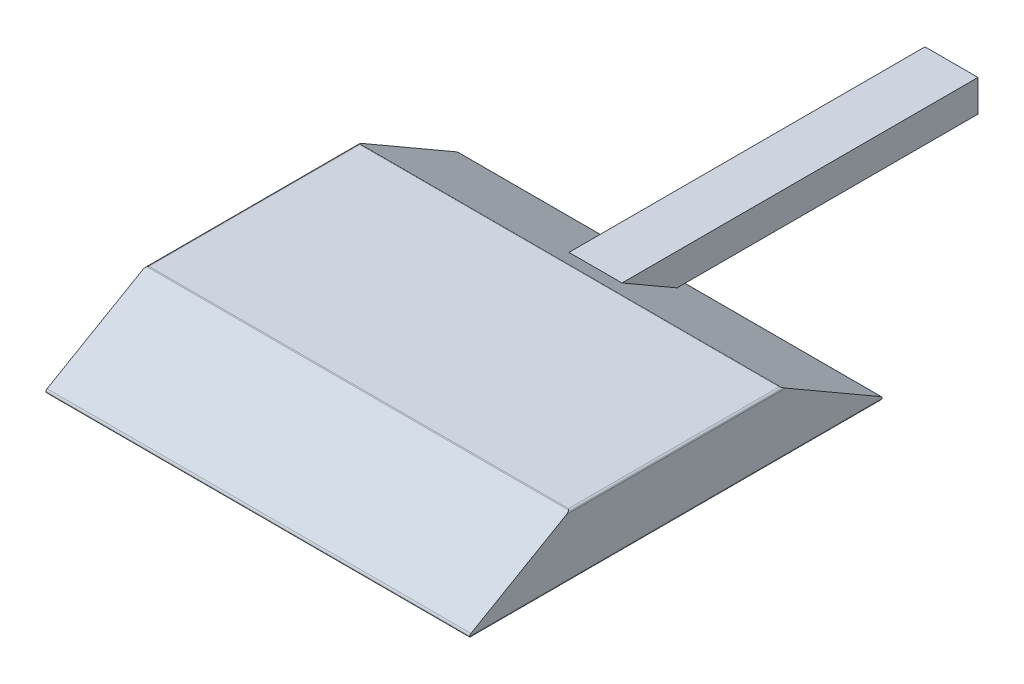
ISO-10303-21;
HEADER;
FILE_DESCRIPTION(('STEP AP214'),'2;1');
FILE_NAME('part.step','',(''),(''),'','','');
FILE_SCHEMA(('AUTOMOTIVE_DESIGN { 1 0 10303 214 1 1 1 1 }'));
ENDSEC;
DATA;
#1=APPLICATION_CONTEXT('core data for automotive mechanical design processes');
#2=APPLICATION_PROTOCOL_DEFINITION('international standard','automotive_design',2000,#1);
#3=PRODUCT_CONTEXT('',#1,'mechanical');
#4=PRODUCT('Part','Part','',(#3));
#5=PRODUCT_RELATED_PRODUCT_CATEGORY('part','',(#4));
#6=PRODUCT_DEFINITION_FORMATION('','',#4);
#7=PRODUCT_DEFINITION_CONTEXT('part definition',#1,'design');
#8=PRODUCT_DEFINITION('design','',#6,#7);
#9=PRODUCT_DEFINITION_SHAPE('','',#8);
#10=(LENGTH_UNIT() NAMED_UNIT(*) SI_UNIT(.MILLI.,.METRE.));
#11=(NAMED_UNIT(*) PLANE_ANGLE_UNIT() SI_UNIT($,.RADIAN.));
#12=(NAMED_UNIT(*) SI_UNIT($,.STERADIAN.) SOLID_ANGLE_UNIT());
#13=UNCERTAINTY_MEASURE_WITH_UNIT(LENGTH_MEASURE(1.E-05),#10,'distance_accuracy_value','');
#14=(GEOMETRIC_REPRESENTATION_CONTEXT(3) GLOBAL_UNCERTAINTY_ASSIGNED_CONTEXT((#13)) GLOBAL_UNIT_ASSIGNED_CONTEXT((#10,
#11,#12)) REPRESENTATION_CONTEXT('',''));
#15=CARTESIAN_POINT('',(0.,0.,0.));
#16=DIRECTION('',(0.,0.,1.));
#17=DIRECTION('',(1.,0.,0.));
#18=AXIS2_PLACEMENT_3D('',#15,#16,#17);
#19=CARTESIAN_POINT('',(25.4,3.66617420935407,-12.7));
#20=DIRECTION('',(0.,-0.866025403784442,0.499999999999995));
#21=DIRECTION('',(0.,-0.499999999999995,-0.866025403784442));
#22=AXIS2_PLACEMENT_3D('',#19,#20,#21);
#23=PLANE('',#22);
#24=DIRECTION('',(-1.,0.,0.));
#25=VECTOR('',#24,1.);
#26=CARTESIAN_POINT('',(25.4,3.63214466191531,-12.7589409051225));
#27=LINE('',#26,#25);
#28=CARTESIAN_POINT('',(-25.2730000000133,3.63214466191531,-12.7589409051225));
#29=VERTEX_POINT('',#28);
#30=CARTESIAN_POINT('',(25.2730000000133,3.63214466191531,-12.7589409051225));
#31=VERTEX_POINT('',#30);
#32=EDGE_CURVE('E218',#29,#31,#27,.F.);
#33=ORIENTED_EDGE('',*,*,#32,.T.);
#34=CARTESIAN_POINT('',(25.146,3.41217420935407,-13.1399409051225));
#35=DIRECTION('',(0.,-0.866025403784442,0.499999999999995));
#36=DIRECTION('',(0.,-0.499999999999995,-0.866025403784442));
#37=AXIS2_PLACEMENT_3D('',#34,#35,#36);
#38=ELLIPSE('',#37,0.508000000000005,0.254);
#39=CARTESIAN_POINT('',(25.4,3.41217420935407,-13.1399409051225));
#40=VERTEX_POINT('',#39);
#41=EDGE_CURVE('E221',#31,#40,#38,.F.);
#42=ORIENTED_EDGE('',*,*,#41,.T.);
#43=DIRECTION('',(0.,0.499999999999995,0.866025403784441));
#44=VECTOR('',#43,1.);
#45=CARTESIAN_POINT('',(25.4,3.66617420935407,-12.7));
#46=LINE('',#45,#44);
#47=CARTESIAN_POINT('',(25.4,-3.19220375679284,-24.5790590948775));
#48=VERTEX_POINT('',#47);
#49=EDGE_CURVE('E188',#48,#40,#46,.T.);
#50=ORIENTED_EDGE('',*,*,#49,.F.);
#51=DIRECTION('',(-1.,0.,0.));
#52=VECTOR('',#51,1.);
#53=CARTESIAN_POINT('',(25.4,-3.19220375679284,-24.5790590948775));
#54=LINE('',#53,#52);
#55=CARTESIAN_POINT('',(-25.4,-3.19220375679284,-24.5790590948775));
#56=VERTEX_POINT('',#55);
#57=EDGE_CURVE('E214',#48,#56,#54,.T.);
#58=ORIENTED_EDGE('',*,*,#57,.T.);
#59=DIRECTION('',(0.,0.499999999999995,0.866025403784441));
#60=VECTOR('',#59,1.);
#61=CARTESIAN_POINT('',(-25.4,3.66617420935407,-12.7));
#62=LINE('',#61,#60);
#63=CARTESIAN_POINT('',(-25.4,3.41217420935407,-13.1399409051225));
#64=VERTEX_POINT('',#63);
#65=EDGE_CURVE('E179',#56,#64,#62,.T.);
#66=ORIENTED_EDGE('',*,*,#65,.T.);
#67=CARTESIAN_POINT('',(-25.146,3.41217420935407,-13.1399409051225));
#68=DIRECTION('',(0.,-0.866025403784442,0.499999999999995));
#69=DIRECTION('',(0.,0.499999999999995,0.866025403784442));
#70=AXIS2_PLACEMENT_3D('',#67,#68,#69);
#71=ELLIPSE('',#70,0.508000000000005,0.254);
#72=EDGE_CURVE('E216',#64,#29,#71,.F.);
#73=ORIENTED_EDGE('',*,*,#72,.T.);
#74=EDGE_LOOP('',(#33,#42,#50,#58,#66,#73));
#75=FACE_BOUND('',#74,.T.);
#76=DIRECTION('',(0.,0.499999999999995,0.866025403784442));
#77=VECTOR('',#76,1.);
#78=CARTESIAN_POINT('',(-3.17500000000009,3.66617420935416,-12.6999999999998));
#79=LINE('',#78,#77);
#80=CARTESIAN_POINT('',(-3.17500000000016,-1.905,-22.3495567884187));
#81=VERTEX_POINT('',#80);
#82=CARTESIAN_POINT('',(-3.17500000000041,1.905,-15.7504432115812));
#83=VERTEX_POINT('',#82);
#84=EDGE_CURVE('E178',#81,#83,#79,.T.);
#85=ORIENTED_EDGE('',*,*,#84,.F.);
#86=DIRECTION('',(-1.,0.,0.));
#87=VECTOR('',#86,1.);
#88=CARTESIAN_POINT('',(25.4,-1.905,-22.3495567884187));
#89=LINE('',#88,#87);
#90=CARTESIAN_POINT('',(3.17499999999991,-1.905,-22.3495567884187));
#91=VERTEX_POINT('',#90);
#92=EDGE_CURVE('E193',#91,#81,#89,.T.);
#93=ORIENTED_EDGE('',*,*,#92,.F.);
#94=DIRECTION('',(0.,-0.499999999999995,-0.866025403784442));
#95=VECTOR('',#94,1.);
#96=CARTESIAN_POINT('',(3.17499999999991,3.66617420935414,-12.6999999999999));
#97=LINE('',#96,#95);
#98=CARTESIAN_POINT('',(3.17499999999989,1.905,-15.7504432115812));
#99=VERTEX_POINT('',#98);
#100=EDGE_CURVE('E199',#99,#91,#97,.T.);
#101=ORIENTED_EDGE('',*,*,#100,.F.);
#102=DIRECTION('',(1.,0.,0.));
#103=VECTOR('',#102,1.);
#104=CARTESIAN_POINT('',(25.4,1.905,-15.7504432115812));
#105=LINE('',#104,#103);
#106=EDGE_CURVE('E202',#83,#99,#105,.T.);
#107=ORIENTED_EDGE('',*,*,#106,.F.);
#108=EDGE_LOOP('',(#85,#93,#101,#107));
#109=FACE_BOUND('',#108,.T.);
#110=ADVANCED_FACE('F41',(#75,#109),#23,.F.);
#111=CARTESIAN_POINT('',(25.4,3.66617420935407,12.7));
#112=DIRECTION('',(0.,-1.,0.));
#113=DIRECTION('',(0.,0.,-1.));
#114=AXIS2_PLACEMENT_3D('',#111,#112,#113);
#115=PLANE('',#114);
#116=DIRECTION('',(0.,0.,1.));
#117=VECTOR('',#116,1.);
#118=CARTESIAN_POINT('',(25.146,3.66617420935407,-12.7));
#119=LINE('',#118,#117);
#120=CARTESIAN_POINT('',(25.146,3.66617420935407,12.6319409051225));
#121=VERTEX_POINT('',#120);
#122=CARTESIAN_POINT('',(25.146,3.66617420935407,-12.6319409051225));
#123=VERTEX_POINT('',#122);
#124=EDGE_CURVE('E209',#121,#123,#119,.F.);
#125=ORIENTED_EDGE('',*,*,#124,.T.);
#126=DIRECTION('',(-1.,0.,0.));
#127=VECTOR('',#126,1.);
#128=CARTESIAN_POINT('',(25.4,3.66617420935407,-12.6319409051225));
#129=LINE('',#128,#127);
#130=CARTESIAN_POINT('',(-25.146,3.66617420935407,-12.6319409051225));
#131=VERTEX_POINT('',#130);
#132=EDGE_CURVE('E211',#123,#131,#129,.T.);
#133=ORIENTED_EDGE('',*,*,#132,.T.);
#134=DIRECTION('',(0.,0.,1.));
#135=VECTOR('',#134,1.);
#136=CARTESIAN_POINT('',(-25.146,3.66617420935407,12.7));
#137=LINE('',#136,#135);
#138=CARTESIAN_POINT('',(-25.146,3.66617420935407,12.6319409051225));
#139=VERTEX_POINT('',#138);
#140=EDGE_CURVE('E205',#131,#139,#137,.T.);
#141=ORIENTED_EDGE('',*,*,#140,.T.);
#142=DIRECTION('',(-1.,0.,0.));
#143=VECTOR('',#142,1.);
#144=CARTESIAN_POINT('',(25.4,3.66617420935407,12.6319409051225));
#145=LINE('',#144,#143);
#146=EDGE_CURVE('E207',#139,#121,#145,.F.);
#147=ORIENTED_EDGE('',*,*,#146,.T.);
#148=EDGE_LOOP('',(#125,#133,#141,#147));
#149=FACE_BOUND('',#148,.T.);
#150=ADVANCED_FACE('F319',(#149),#115,.F.);
#151=CARTESIAN_POINT('',(25.4,-3.66617420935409,25.4));
#152=DIRECTION('',(0.,-0.866025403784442,-0.499999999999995));
#153=DIRECTION('',(0.,0.499999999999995,-0.866025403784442));
#154=AXIS2_PLACEMENT_3D('',#151,#152,#153);
#155=PLANE('',#154);
#156=DIRECTION('',(0.,-0.499999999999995,0.866025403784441));
#157=VECTOR('',#156,1.);
#158=CARTESIAN_POINT('',(25.4,-3.66617420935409,25.4));
#159=LINE('',#158,#157);
#160=CARTESIAN_POINT('',(25.4,3.41217420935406,13.1399409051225));
#161=VERTEX_POINT('',#160);
#162=CARTESIAN_POINT('',(25.4,-3.19220375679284,24.5790590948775));
#163=VERTEX_POINT('',#162);
#164=EDGE_CURVE('E191',#161,#163,#159,.T.);
#165=ORIENTED_EDGE('',*,*,#164,.F.);
#166=CARTESIAN_POINT('',(25.146,3.41217420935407,13.1399409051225));
#167=DIRECTION('',(0.,-0.866025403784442,-0.499999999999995));
#168=DIRECTION('',(0.,0.499999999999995,-0.866025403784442));
#169=AXIS2_PLACEMENT_3D('',#166,#167,#168);
#170=ELLIPSE('',#169,0.508000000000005,0.254);
#171=CARTESIAN_POINT('',(25.2730000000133,3.63214466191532,12.7589409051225));
#172=VERTEX_POINT('',#171);
#173=EDGE_CURVE('E238',#161,#172,#170,.F.);
#174=ORIENTED_EDGE('',*,*,#173,.T.);
#175=DIRECTION('',(-1.,0.,0.));
#176=VECTOR('',#175,1.);
#177=CARTESIAN_POINT('',(25.4,3.63214466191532,12.7589409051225));
#178=LINE('',#177,#176);
#179=CARTESIAN_POINT('',(-25.2730000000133,3.63214466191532,12.7589409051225));
#180=VERTEX_POINT('',#179);
#181=EDGE_CURVE('E236',#172,#180,#178,.T.);
#182=ORIENTED_EDGE('',*,*,#181,.T.);
#183=CARTESIAN_POINT('',(-25.146,3.41217420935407,13.1399409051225));
#184=DIRECTION('',(0.,-0.866025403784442,-0.499999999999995));
#185=DIRECTION('',(0.,-0.499999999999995,0.866025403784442));
#186=AXIS2_PLACEMENT_3D('',#183,#184,#185);
#187=ELLIPSE('',#186,0.508000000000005,0.254);
#188=CARTESIAN_POINT('',(-25.4,3.41217420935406,13.1399409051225));
#189=VERTEX_POINT('',#188);
#190=EDGE_CURVE('E234',#180,#189,#187,.F.);
#191=ORIENTED_EDGE('',*,*,#190,.T.);
#192=DIRECTION('',(0.,-0.499999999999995,0.866025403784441));
#193=VECTOR('',#192,1.);
#194=CARTESIAN_POINT('',(-25.4,-3.66617420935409,25.4));
#195=LINE('',#194,#193);
#196=CARTESIAN_POINT('',(-25.4,-3.19220375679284,24.5790590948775));
#197=VERTEX_POINT('',#196);
#198=EDGE_CURVE('E182',#189,#197,#195,.T.);
#199=ORIENTED_EDGE('',*,*,#198,.T.);
#200=DIRECTION('',(-1.,0.,0.));
#201=VECTOR('',#200,1.);
#202=CARTESIAN_POINT('',(25.4,-3.19220375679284,24.5790590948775));
#203=LINE('',#202,#201);
#204=EDGE_CURVE('E231',#197,#163,#203,.F.);
#205=ORIENTED_EDGE('',*,*,#204,.T.);
#206=EDGE_LOOP('',(#165,#174,#182,#191,#199,#205));
#207=FACE_BOUND('',#206,.T.);
#208=ADVANCED_FACE('F296',(#207),#155,.F.);
#209=CARTESIAN_POINT('',(25.4,-3.66617420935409,-25.4));
#210=DIRECTION('',(0.,1.,0.));
#211=DIRECTION('',(0.,0.,1.));
#212=AXIS2_PLACEMENT_3D('',#209,#210,#211);
#213=PLANE('',#212);
#214=DIRECTION('',(0.,0.,-1.));
#215=VECTOR('',#214,1.);
#216=CARTESIAN_POINT('',(25.146,-3.66617420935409,25.4));
#217=LINE('',#216,#215);
#218=CARTESIAN_POINT('',(25.146,-3.66617420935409,-24.4520590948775));
#219=VERTEX_POINT('',#218);
#220=CARTESIAN_POINT('',(25.146,-3.66617420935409,24.4520590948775));
#221=VERTEX_POINT('',#220);
#222=EDGE_CURVE('E50',#219,#221,#217,.F.);
#223=ORIENTED_EDGE('',*,*,#222,.T.);
#224=DIRECTION('',(-1.,0.,0.));
#225=VECTOR('',#224,1.);
#226=CARTESIAN_POINT('',(25.4,-3.66617420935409,24.4520590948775));
#227=LINE('',#226,#225);
#228=CARTESIAN_POINT('',(-25.146,-3.66617420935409,24.4520590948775));
#229=VERTEX_POINT('',#228);
#230=EDGE_CURVE('E11',#221,#229,#227,.T.);
#231=ORIENTED_EDGE('',*,*,#230,.T.);
#232=DIRECTION('',(0.,0.,-1.));
#233=VECTOR('',#232,1.);
#234=CARTESIAN_POINT('',(-25.146,-3.66617420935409,-25.4));
#235=LINE('',#234,#233);
#236=CARTESIAN_POINT('',(-25.146,-3.66617420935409,-24.4520590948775));
#237=VERTEX_POINT('',#236);
#238=EDGE_CURVE('E248',#229,#237,#235,.T.);
#239=ORIENTED_EDGE('',*,*,#238,.T.);
#240=DIRECTION('',(-1.,0.,0.));
#241=VECTOR('',#240,1.);
#242=CARTESIAN_POINT('',(25.4,-3.66617420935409,-24.4520590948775));
#243=LINE('',#242,#241);
#244=EDGE_CURVE('E61',#237,#219,#243,.F.);
#245=ORIENTED_EDGE('',*,*,#244,.T.);
#246=EDGE_LOOP('',(#223,#231,#239,#245));
#247=FACE_BOUND('',#246,.T.);
#248=ADVANCED_FACE('F305',(#247),#213,.F.);
#249=CARTESIAN_POINT('',(25.4,0.,0.));
#250=DIRECTION('',(1.,0.,0.));
#251=DIRECTION('',(0.,0.,-1.));
#252=AXIS2_PLACEMENT_3D('',#249,#250,#251);
#253=PLANE('',#252);
#254=ORIENTED_EDGE('',*,*,#49,.T.);
#255=DIRECTION('',(0.,0.,1.));
#256=VECTOR('',#255,1.);
#257=CARTESIAN_POINT('',(25.4,3.41217420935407,12.7));
#258=LINE('',#257,#256);
#259=EDGE_CURVE('E229',#40,#161,#258,.T.);
#260=ORIENTED_EDGE('',*,*,#259,.T.);
#261=ORIENTED_EDGE('',*,*,#164,.T.);
#262=CARTESIAN_POINT('',(25.4,-3.41217420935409,24.4520590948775));
#263=DIRECTION('',(1.,0.,0.));
#264=DIRECTION('',(0.,0.,-1.));
#265=AXIS2_PLACEMENT_3D('',#262,#263,#264);
#266=CIRCLE('',#265,0.254);
#267=CARTESIAN_POINT('',(25.4,-3.41217420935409,24.7060590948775));
#268=VERTEX_POINT('',#267);
#269=EDGE_CURVE('E227',#163,#268,#266,.T.);
#270=ORIENTED_EDGE('',*,*,#269,.T.);
#271=DIRECTION('',(0.,0.,-1.));
#272=VECTOR('',#271,1.);
#273=CARTESIAN_POINT('',(25.4,-3.41217420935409,-25.4));
#274=LINE('',#273,#272);
#275=CARTESIAN_POINT('',(25.4,-3.41217420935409,-24.7060590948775));
#276=VERTEX_POINT('',#275);
#277=EDGE_CURVE('E225',#268,#276,#274,.T.);
#278=ORIENTED_EDGE('',*,*,#277,.T.);
#279=CARTESIAN_POINT('',(25.4,-3.41217420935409,-24.4520590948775));
#280=DIRECTION('',(1.,0.,0.));
#281=DIRECTION('',(0.,0.,-1.));
#282=AXIS2_PLACEMENT_3D('',#279,#280,#281);
#283=CIRCLE('',#282,0.254);
#284=EDGE_CURVE('E223',#276,#48,#283,.T.);
#285=ORIENTED_EDGE('',*,*,#284,.T.);
#286=EDGE_LOOP('',(#254,#260,#261,#270,#278,#285));
#287=FACE_BOUND('',#286,.T.);
#288=ADVANCED_FACE('F281',(#287),#253,.T.);
#289=CARTESIAN_POINT('',(-25.4,0.,0.));
#290=DIRECTION('',(1.,0.,0.));
#291=DIRECTION('',(0.,0.,-1.));
#292=AXIS2_PLACEMENT_3D('',#289,#290,#291);
#293=PLANE('',#292);
#294=ORIENTED_EDGE('',*,*,#198,.F.);
#295=DIRECTION('',(0.,0.,1.));
#296=VECTOR('',#295,1.);
#297=CARTESIAN_POINT('',(-25.4,3.41217420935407,0.));
#298=LINE('',#297,#296);
#299=EDGE_CURVE('E246',#189,#64,#298,.F.);
#300=ORIENTED_EDGE('',*,*,#299,.T.);
#301=ORIENTED_EDGE('',*,*,#65,.F.);
#302=CARTESIAN_POINT('',(-25.4,-3.41217420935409,-24.4520590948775));
#303=DIRECTION('',(1.,0.,0.));
#304=DIRECTION('',(0.,0.,-1.));
#305=AXIS2_PLACEMENT_3D('',#302,#303,#304);
#306=CIRCLE('',#305,0.254);
#307=CARTESIAN_POINT('',(-25.4,-3.41217420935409,-24.7060590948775));
#308=VERTEX_POINT('',#307);
#309=EDGE_CURVE('E242',#56,#308,#306,.F.);
#310=ORIENTED_EDGE('',*,*,#309,.T.);
#311=DIRECTION('',(0.,0.,-1.));
#312=VECTOR('',#311,1.);
#313=CARTESIAN_POINT('',(-25.4,-3.41217420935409,0.));
#314=LINE('',#313,#312);
#315=CARTESIAN_POINT('',(-25.4,-3.41217420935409,24.7060590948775));
#316=VERTEX_POINT('',#315);
#317=EDGE_CURVE('E240',#308,#316,#314,.F.);
#318=ORIENTED_EDGE('',*,*,#317,.T.);
#319=CARTESIAN_POINT('',(-25.4,-3.41217420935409,24.4520590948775));
#320=DIRECTION('',(1.,0.,0.));
#321=DIRECTION('',(0.,0.,-1.));
#322=AXIS2_PLACEMENT_3D('',#319,#320,#321);
#323=CIRCLE('',#322,0.254);
#324=EDGE_CURVE('E244',#316,#197,#323,.F.);
#325=ORIENTED_EDGE('',*,*,#324,.T.);
#326=EDGE_LOOP('',(#294,#300,#301,#310,#318,#325));
#327=FACE_BOUND('',#326,.T.);
#328=ADVANCED_FACE('F308',(#327),#293,.F.);
#329=CARTESIAN_POINT('',(-3.17500000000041,1.905,-58.42));
#330=DIRECTION('',(1.,0.,0.));
#331=DIRECTION('',(0.,0.,-1.));
#332=AXIS2_PLACEMENT_3D('',#329,#330,#331);
#333=PLANE('',#332);
#334=DIRECTION('',(0.,0.,1.));
#335=VECTOR('',#334,1.);
#336=CARTESIAN_POINT('',(-3.17500000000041,-1.905,-58.42));
#337=LINE('',#336,#335);
#338=CARTESIAN_POINT('',(-3.17500000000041,-1.905,-58.42));
#339=VERTEX_POINT('',#338);
#340=EDGE_CURVE('E482',#339,#81,#337,.T.);
#341=ORIENTED_EDGE('',*,*,#340,.T.);
#342=ORIENTED_EDGE('',*,*,#84,.T.);
#343=DIRECTION('',(0.,0.,1.));
#344=VECTOR('',#343,1.);
#345=CARTESIAN_POINT('',(-3.17500000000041,1.905,-58.42));
#346=LINE('',#345,#344);
#347=CARTESIAN_POINT('',(-3.17500000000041,1.905,-58.42));
#348=VERTEX_POINT('',#347);
#349=EDGE_CURVE('E159',#348,#83,#346,.T.);
#350=ORIENTED_EDGE('',*,*,#349,.F.);
#351=DIRECTION('',(0.,1.,0.));
#352=VECTOR('',#351,1.);
#353=CARTESIAN_POINT('',(-3.17500000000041,1.905,-58.42));
#354=LINE('',#353,#352);
#355=EDGE_CURVE('E165',#339,#348,#354,.T.);
#356=ORIENTED_EDGE('',*,*,#355,.F.);
#357=EDGE_LOOP('',(#341,#342,#350,#356));
#358=FACE_BOUND('',#357,.T.);
#359=ADVANCED_FACE('F177',(#358),#333,.F.);
#360=CARTESIAN_POINT('',(3.17499999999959,1.905,-58.42));
#361=DIRECTION('',(0.,-1.,0.));
#362=DIRECTION('',(0.,0.,-1.));
#363=AXIS2_PLACEMENT_3D('',#360,#361,#362);
#364=PLANE('',#363);
#365=ORIENTED_EDGE('',*,*,#349,.T.);
#366=ORIENTED_EDGE('',*,*,#106,.T.);
#367=DIRECTION('',(0.,0.,1.));
#368=VECTOR('',#367,1.);
#369=CARTESIAN_POINT('',(3.17499999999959,1.905,-58.42));
#370=LINE('',#369,#368);
#371=CARTESIAN_POINT('',(3.17499999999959,1.905,-58.42));
#372=VERTEX_POINT('',#371);
#373=EDGE_CURVE('E161',#372,#99,#370,.T.);
#374=ORIENTED_EDGE('',*,*,#373,.F.);
#375=DIRECTION('',(1.,0.,0.));
#376=VECTOR('',#375,1.);
#377=CARTESIAN_POINT('',(3.17499999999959,1.905,-58.42));
#378=LINE('',#377,#376);
#379=EDGE_CURVE('E154',#348,#372,#378,.T.);
#380=ORIENTED_EDGE('',*,*,#379,.F.);
#381=EDGE_LOOP('',(#365,#366,#374,#380));
#382=FACE_BOUND('',#381,.T.);
#383=ADVANCED_FACE('F156',(#382),#364,.F.);
#384=CARTESIAN_POINT('',(3.17499999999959,1.905,-58.42));
#385=DIRECTION('',(-1.,0.,0.));
#386=DIRECTION('',(0.,0.,1.));
#387=AXIS2_PLACEMENT_3D('',#384,#385,#386);
#388=PLANE('',#387);
#389=ORIENTED_EDGE('',*,*,#373,.T.);
#390=ORIENTED_EDGE('',*,*,#100,.T.);
#391=DIRECTION('',(0.,0.,1.));
#392=VECTOR('',#391,1.);
#393=CARTESIAN_POINT('',(3.17499999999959,-1.905,-58.42));
#394=LINE('',#393,#392);
#395=CARTESIAN_POINT('',(3.17499999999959,-1.905,-58.42));
#396=VERTEX_POINT('',#395);
#397=EDGE_CURVE('E184',#396,#91,#394,.T.);
#398=ORIENTED_EDGE('',*,*,#397,.F.);
#399=DIRECTION('',(0.,-1.,0.));
#400=VECTOR('',#399,1.);
#401=CARTESIAN_POINT('',(3.17499999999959,1.905,-58.42));
#402=LINE('',#401,#400);
#403=EDGE_CURVE('E164',#372,#396,#402,.T.);
#404=ORIENTED_EDGE('',*,*,#403,.F.);
#405=EDGE_LOOP('',(#389,#390,#398,#404));
#406=FACE_BOUND('',#405,.T.);
#407=ADVANCED_FACE('F408',(#406),#388,.F.);
#408=CARTESIAN_POINT('',(3.17499999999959,-1.905,-58.42));
#409=DIRECTION('',(0.,1.,0.));
#410=DIRECTION('',(0.,0.,1.));
#411=AXIS2_PLACEMENT_3D('',#408,#409,#410);
#412=PLANE('',#411);
#413=ORIENTED_EDGE('',*,*,#397,.T.);
#414=ORIENTED_EDGE('',*,*,#92,.T.);
#415=ORIENTED_EDGE('',*,*,#340,.F.);
#416=DIRECTION('',(-1.,0.,0.));
#417=VECTOR('',#416,1.);
#418=CARTESIAN_POINT('',(3.17499999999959,-1.905,-58.42));
#419=LINE('',#418,#417);
#420=EDGE_CURVE('E170',#396,#339,#419,.T.);
#421=ORIENTED_EDGE('',*,*,#420,.F.);
#422=EDGE_LOOP('',(#413,#414,#415,#421));
#423=FACE_BOUND('',#422,.T.);
#424=ADVANCED_FACE('F333',(#423),#412,.F.);
#425=CARTESIAN_POINT('',(-4.0946667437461E-13,0.,-58.42));
#426=DIRECTION('',(0.,0.,-1.));
#427=DIRECTION('',(-1.,0.,0.));
#428=AXIS2_PLACEMENT_3D('',#425,#426,#427);
#429=PLANE('',#428);
#430=ORIENTED_EDGE('',*,*,#355,.T.);
#431=ORIENTED_EDGE('',*,*,#379,.T.);
#432=ORIENTED_EDGE('',*,*,#403,.T.);
#433=ORIENTED_EDGE('',*,*,#420,.T.);
#434=EDGE_LOOP('',(#430,#431,#432,#433));
#435=FACE_BOUND('',#434,.T.);
#436=ADVANCED_FACE('F168',(#435),#429,.T.);
#437=CARTESIAN_POINT('',(25.4,3.41217420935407,12.6319409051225));
#438=DIRECTION('',(-1.,0.,0.));
#439=DIRECTION('',(0.,0.,1.));
#440=AXIS2_PLACEMENT_3D('',#437,#438,#439);
#441=CYLINDRICAL_SURFACE('',#440,0.254);
#442=CARTESIAN_POINT('',(-25.146,3.41217420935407,12.6319409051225));
#443=DIRECTION('',(0.707106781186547,0.,0.707106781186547));
#444=DIRECTION('',(-0.707106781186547,0.,0.707106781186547));
#445=AXIS2_PLACEMENT_3D('',#442,#443,#444);
#446=ELLIPSE('',#445,0.359210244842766,0.254);
#447=EDGE_CURVE('E256',#180,#139,#446,.F.);
#448=ORIENTED_EDGE('',*,*,#447,.F.);
#449=ORIENTED_EDGE('',*,*,#181,.F.);
#450=CARTESIAN_POINT('',(25.146,3.41217420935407,12.6319409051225));
#451=DIRECTION('',(-0.707106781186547,0.,0.707106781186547));
#452=DIRECTION('',(-0.707106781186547,0.,-0.707106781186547));
#453=AXIS2_PLACEMENT_3D('',#450,#451,#452);
#454=ELLIPSE('',#453,0.359210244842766,0.254);
#455=EDGE_CURVE('E174',#121,#172,#454,.F.);
#456=ORIENTED_EDGE('',*,*,#455,.F.);
#457=ORIENTED_EDGE('',*,*,#146,.F.);
#458=EDGE_LOOP('',(#448,#449,#456,#457));
#459=FACE_BOUND('',#458,.T.);
#460=ADVANCED_FACE('F324',(#459),#441,.T.);
#461=CARTESIAN_POINT('',(25.146,3.41217420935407,0.));
#462=DIRECTION('',(0.,0.,-1.));
#463=DIRECTION('',(-1.,0.,0.));
#464=AXIS2_PLACEMENT_3D('',#461,#462,#463);
#465=CYLINDRICAL_SURFACE('',#464,0.254);
#466=ORIENTED_EDGE('',*,*,#259,.F.);
#467=ORIENTED_EDGE('',*,*,#41,.F.);
#468=CARTESIAN_POINT('',(25.146,3.41217420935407,-12.6319409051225));
#469=DIRECTION('',(-0.707106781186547,0.,-0.707106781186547));
#470=DIRECTION('',(0.707106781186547,0.,-0.707106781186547));
#471=AXIS2_PLACEMENT_3D('',#468,#469,#470);
#472=ELLIPSE('',#471,0.359210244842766,0.254);
#473=EDGE_CURVE('E254',#123,#31,#472,.T.);
#474=ORIENTED_EDGE('',*,*,#473,.F.);
#475=ORIENTED_EDGE('',*,*,#124,.F.);
#476=ORIENTED_EDGE('',*,*,#455,.T.);
#477=ORIENTED_EDGE('',*,*,#173,.F.);
#478=EDGE_LOOP('',(#466,#467,#474,#475,#476,#477));
#479=FACE_BOUND('',#478,.T.);
#480=ADVANCED_FACE('F290',(#479),#465,.T.);
#481=CARTESIAN_POINT('',(-25.146,3.41217420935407,12.7));
#482=DIRECTION('',(0.,0.,1.));
#483=DIRECTION('',(1.,0.,0.));
#484=AXIS2_PLACEMENT_3D('',#481,#482,#483);
#485=CYLINDRICAL_SURFACE('',#484,0.254);
#486=ORIENTED_EDGE('',*,*,#447,.T.);
#487=ORIENTED_EDGE('',*,*,#140,.F.);
#488=CARTESIAN_POINT('',(-25.146,3.41217420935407,-12.6319409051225));
#489=DIRECTION('',(-0.707106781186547,0.,0.707106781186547));
#490=DIRECTION('',(0.707106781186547,0.,0.707106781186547));
#491=AXIS2_PLACEMENT_3D('',#488,#489,#490);
#492=ELLIPSE('',#491,0.359210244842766,0.254);
#493=EDGE_CURVE('E252',#29,#131,#492,.F.);
#494=ORIENTED_EDGE('',*,*,#493,.F.);
#495=ORIENTED_EDGE('',*,*,#72,.F.);
#496=ORIENTED_EDGE('',*,*,#299,.F.);
#497=ORIENTED_EDGE('',*,*,#190,.F.);
#498=EDGE_LOOP('',(#486,#487,#494,#495,#496,#497));
#499=FACE_BOUND('',#498,.T.);
#500=ADVANCED_FACE('F313',(#499),#485,.T.);
#501=CARTESIAN_POINT('',(25.4,3.41217420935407,-12.6319409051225));
#502=DIRECTION('',(-1.,0.,0.));
#503=DIRECTION('',(0.,0.,1.));
#504=AXIS2_PLACEMENT_3D('',#501,#502,#503);
#505=CYLINDRICAL_SURFACE('',#504,0.254);
#506=ORIENTED_EDGE('',*,*,#473,.T.);
#507=ORIENTED_EDGE('',*,*,#32,.F.);
#508=ORIENTED_EDGE('',*,*,#493,.T.);
#509=ORIENTED_EDGE('',*,*,#132,.F.);
#510=EDGE_LOOP('',(#506,#507,#508,#509));
#511=FACE_BOUND('',#510,.T.);
#512=ADVANCED_FACE('F317',(#511),#505,.T.);
#513=CARTESIAN_POINT('',(25.4,-3.41217420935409,-24.4520590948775));
#514=DIRECTION('',(-1.,0.,0.));
#515=DIRECTION('',(0.,0.,1.));
#516=AXIS2_PLACEMENT_3D('',#513,#514,#515);
#517=CYLINDRICAL_SURFACE('',#516,0.254);
#518=ORIENTED_EDGE('',*,*,#57,.F.);
#519=ORIENTED_EDGE('',*,*,#284,.F.);
#520=CARTESIAN_POINT('',(25.146,-3.41217420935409,-24.4520590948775));
#521=DIRECTION('',(-0.707106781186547,0.,-0.707106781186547));
#522=DIRECTION('',(-0.707106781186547,0.,0.707106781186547));
#523=AXIS2_PLACEMENT_3D('',#520,#521,#522);
#524=ELLIPSE('',#523,0.359210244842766,0.254);
#525=EDGE_CURVE('E45',#219,#276,#524,.F.);
#526=ORIENTED_EDGE('',*,*,#525,.F.);
#527=ORIENTED_EDGE('',*,*,#244,.F.);
#528=CARTESIAN_POINT('',(-25.146,-3.41217420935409,-24.4520590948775));
#529=DIRECTION('',(0.707106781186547,0.,-0.707106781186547));
#530=DIRECTION('',(-0.707106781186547,0.,-0.707106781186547));
#531=AXIS2_PLACEMENT_3D('',#528,#529,#530);
#532=ELLIPSE('',#531,0.359210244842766,0.254);
#533=EDGE_CURVE('E265',#308,#237,#532,.F.);
#534=ORIENTED_EDGE('',*,*,#533,.F.);
#535=ORIENTED_EDGE('',*,*,#309,.F.);
#536=EDGE_LOOP('',(#518,#519,#526,#527,#534,#535));
#537=FACE_BOUND('',#536,.T.);
#538=ADVANCED_FACE('F43',(#537),#517,.T.);
#539=CARTESIAN_POINT('',(25.146,-3.41217420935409,0.));
#540=DIRECTION('',(0.,0.,1.));
#541=DIRECTION('',(1.,0.,0.));
#542=AXIS2_PLACEMENT_3D('',#539,#540,#541);
#543=CYLINDRICAL_SURFACE('',#542,0.254);
#544=ORIENTED_EDGE('',*,*,#525,.T.);
#545=ORIENTED_EDGE('',*,*,#277,.F.);
#546=CARTESIAN_POINT('',(25.146,-3.41217420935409,24.4520590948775));
#547=DIRECTION('',(-0.707106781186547,0.,0.707106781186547));
#548=DIRECTION('',(0.707106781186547,0.,0.707106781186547));
#549=AXIS2_PLACEMENT_3D('',#546,#547,#548);
#550=ELLIPSE('',#549,0.359210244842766,0.254);
#551=EDGE_CURVE('E263',#221,#268,#550,.T.);
#552=ORIENTED_EDGE('',*,*,#551,.F.);
#553=ORIENTED_EDGE('',*,*,#222,.F.);
#554=EDGE_LOOP('',(#544,#545,#552,#553));
#555=FACE_BOUND('',#554,.T.);
#556=ADVANCED_FACE('F274',(#555),#543,.T.);
#557=CARTESIAN_POINT('',(-25.146,-3.41217420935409,-25.4));
#558=DIRECTION('',(0.,0.,-1.));
#559=DIRECTION('',(-1.,0.,0.));
#560=AXIS2_PLACEMENT_3D('',#557,#558,#559);
#561=CYLINDRICAL_SURFACE('',#560,0.254);
#562=ORIENTED_EDGE('',*,*,#533,.T.);
#563=ORIENTED_EDGE('',*,*,#238,.F.);
#564=CARTESIAN_POINT('',(-25.146,-3.41217420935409,24.4520590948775));
#565=DIRECTION('',(-0.707106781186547,0.,-0.707106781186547));
#566=DIRECTION('',(0.707106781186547,0.,-0.707106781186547));
#567=AXIS2_PLACEMENT_3D('',#564,#565,#566);
#568=ELLIPSE('',#567,0.359210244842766,0.254);
#569=EDGE_CURVE('E261',#316,#229,#568,.F.);
#570=ORIENTED_EDGE('',*,*,#569,.F.);
#571=ORIENTED_EDGE('',*,*,#317,.F.);
#572=EDGE_LOOP('',(#562,#563,#570,#571));
#573=FACE_BOUND('',#572,.T.);
#574=ADVANCED_FACE('F306',(#573),#561,.T.);
#575=CARTESIAN_POINT('',(25.4,-3.41217420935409,24.4520590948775));
#576=DIRECTION('',(-1.,0.,0.));
#577=DIRECTION('',(0.,0.,1.));
#578=AXIS2_PLACEMENT_3D('',#575,#576,#577);
#579=CYLINDRICAL_SURFACE('',#578,0.254);
#580=ORIENTED_EDGE('',*,*,#269,.F.);
#581=ORIENTED_EDGE('',*,*,#204,.F.);
#582=ORIENTED_EDGE('',*,*,#324,.F.);
#583=ORIENTED_EDGE('',*,*,#569,.T.);
#584=ORIENTED_EDGE('',*,*,#230,.F.);
#585=ORIENTED_EDGE('',*,*,#551,.T.);
#586=EDGE_LOOP('',(#580,#581,#582,#583,#584,#585));
#587=FACE_BOUND('',#586,.T.);
#588=ADVANCED_FACE('F302',(#587),#579,.T.);
#589=CLOSED_SHELL('',(#110,#150,#208,#248,#288,#328,#359,#383,#407,#424,#436,#460,#480,#500,
#512,#538,#556,#574,#588));
#590=MANIFOLD_SOLID_BREP('B2',#589);
#591=ADVANCED_BREP_SHAPE_REPRESENTATION('',(#18,#590),#14);
#592=SHAPE_DEFINITION_REPRESENTATION(#9,#591);
ENDSEC;
END-ISO-10303-21;
